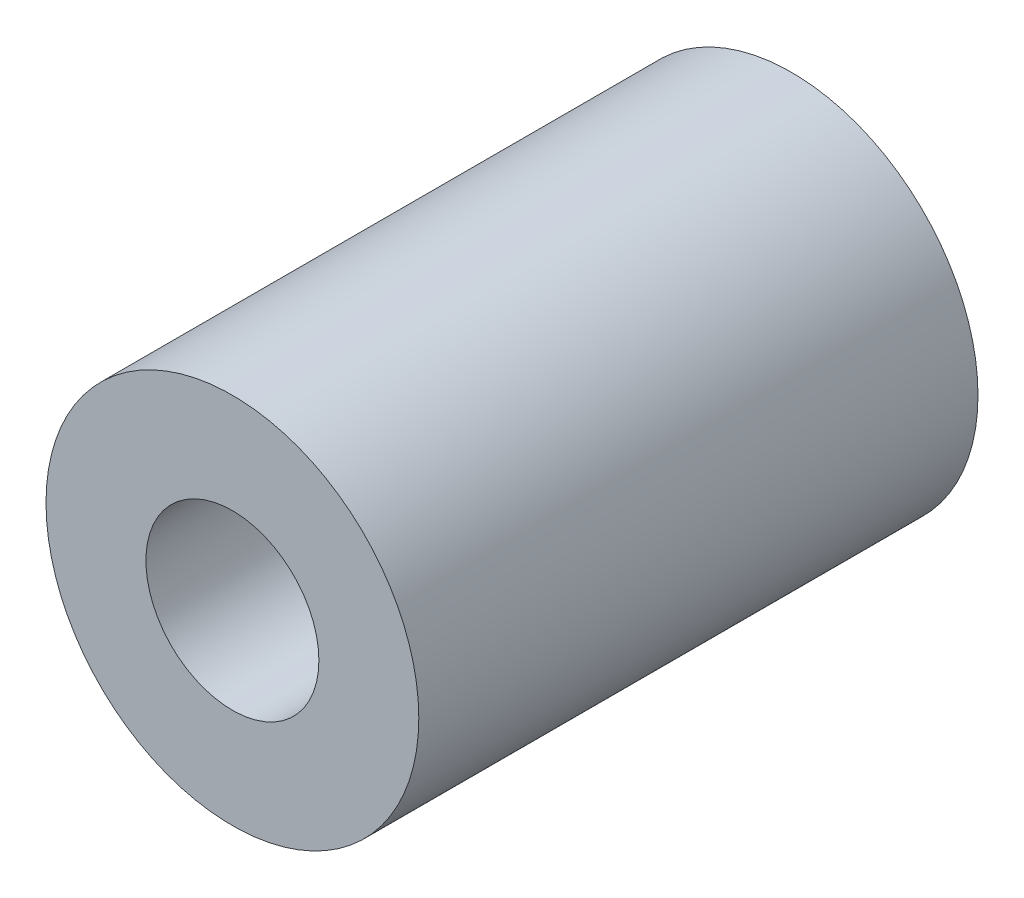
from build123d import *

# Parameters (mm, degrees)
SKETCH1_R             = 3.175
BOSS_EXTRUDE1_DEPTH   = 9.525
F_4_CLEARANCE_HOLE1_D = 2.9464


with BuildPart() as part:
    # Sketch1 → Boss-Extrude1 (new body)
    with BuildSketch(Plane.XY):
        with Locations(Location((0, 0, 0), (0, 0, 180))):
            Circle(SKETCH1_R)
    extrude(amount=BOSS_EXTRUDE1_DEPTH)

    # 4 Clearance Hole1 (through all)
    with Locations(Plane.XY.offset(9.525)):
        with Locations((0, 0)):
            Hole(F_4_CLEARANCE_HOLE1_D / 2)


solid = part.part
